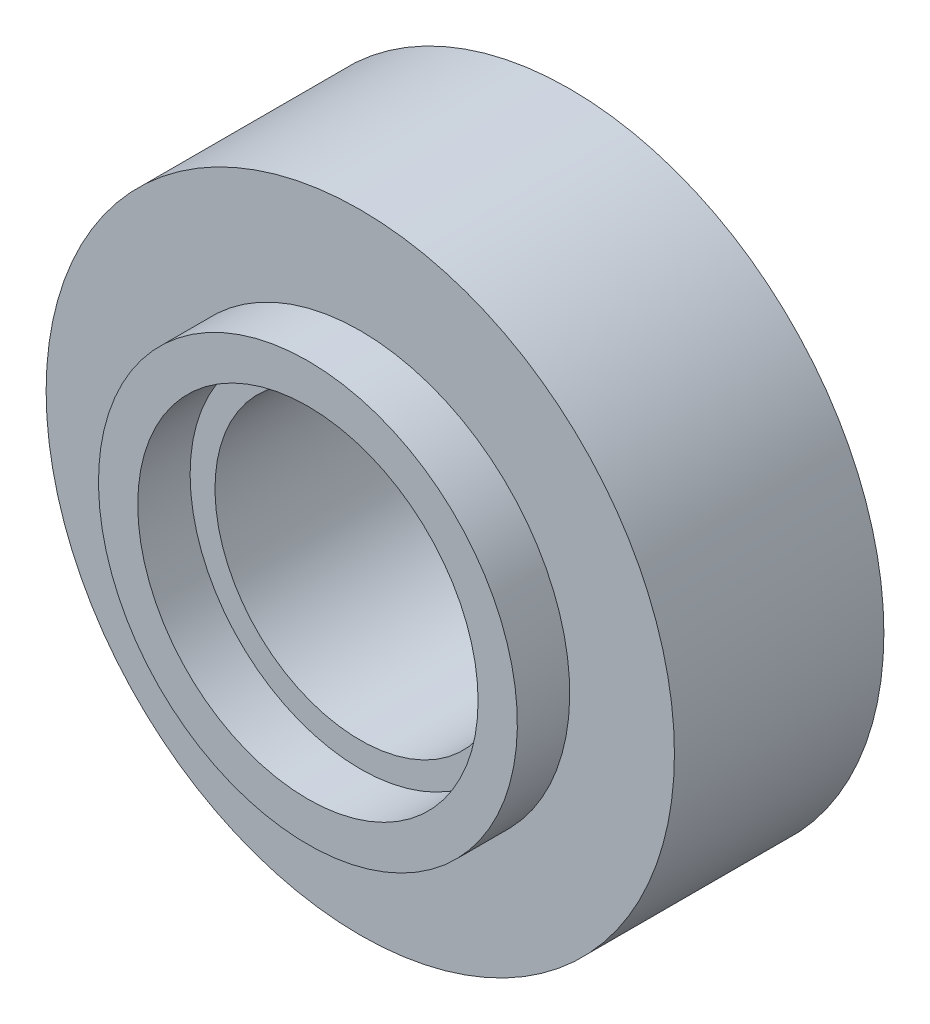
ISO-10303-21;
HEADER;
FILE_DESCRIPTION(('STEP AP214'),'2;1');
FILE_NAME('part.step','',(''),(''),'','','');
FILE_SCHEMA(('AUTOMOTIVE_DESIGN { 1 0 10303 214 1 1 1 1 }'));
ENDSEC;
DATA;
#1=APPLICATION_CONTEXT('core data for automotive mechanical design processes');
#2=APPLICATION_PROTOCOL_DEFINITION('international standard','automotive_design',2000,#1);
#3=PRODUCT_CONTEXT('',#1,'mechanical');
#4=PRODUCT('Part','Part','',(#3));
#5=PRODUCT_RELATED_PRODUCT_CATEGORY('part','',(#4));
#6=PRODUCT_DEFINITION_FORMATION('','',#4);
#7=PRODUCT_DEFINITION_CONTEXT('part definition',#1,'design');
#8=PRODUCT_DEFINITION('design','',#6,#7);
#9=PRODUCT_DEFINITION_SHAPE('','',#8);
#10=(LENGTH_UNIT() NAMED_UNIT(*) SI_UNIT(.MILLI.,.METRE.));
#11=(NAMED_UNIT(*) PLANE_ANGLE_UNIT() SI_UNIT($,.RADIAN.));
#12=(NAMED_UNIT(*) SI_UNIT($,.STERADIAN.) SOLID_ANGLE_UNIT());
#13=UNCERTAINTY_MEASURE_WITH_UNIT(LENGTH_MEASURE(1.E-05),#10,'distance_accuracy_value','');
#14=(GEOMETRIC_REPRESENTATION_CONTEXT(3) GLOBAL_UNCERTAINTY_ASSIGNED_CONTEXT((#13)) GLOBAL_UNIT_ASSIGNED_CONTEXT((#10,
#11,#12)) REPRESENTATION_CONTEXT('',''));
#15=CARTESIAN_POINT('',(0.,0.,0.));
#16=DIRECTION('',(0.,0.,1.));
#17=DIRECTION('',(1.,0.,0.));
#18=AXIS2_PLACEMENT_3D('',#15,#16,#17);
#19=CARTESIAN_POINT('',(0.,0.,-39.));
#20=DIRECTION('',(0.,0.,-1.));
#21=DIRECTION('',(0.,1.,0.));
#22=AXIS2_PLACEMENT_3D('',#19,#20,#21);
#23=PLANE('',#22);
#24=CARTESIAN_POINT('',(0.,0.,-39.));
#25=DIRECTION('',(0.,0.,-1.));
#26=DIRECTION('',(0.,1.,0.));
#27=AXIS2_PLACEMENT_3D('',#24,#25,#26);
#28=CIRCLE('',#27,8.);
#29=CARTESIAN_POINT('',(0.,8.00000000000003,-39.));
#30=VERTEX_POINT('',#29);
#31=EDGE_CURVE('E37',#30,#30,#28,.T.);
#32=ORIENTED_EDGE('',*,*,#31,.F.);
#33=EDGE_LOOP('',(#32));
#34=FACE_BOUND('',#33,.T.);
#35=CARTESIAN_POINT('',(0.,0.,-39.));
#36=DIRECTION('',(0.,0.,-1.));
#37=DIRECTION('',(0.,1.,0.));
#38=AXIS2_PLACEMENT_3D('',#35,#36,#37);
#39=CIRCLE('',#38,6.49999999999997);
#40=CARTESIAN_POINT('',(0.,6.5,-39.));
#41=VERTEX_POINT('',#40);
#42=EDGE_CURVE('E44',#41,#41,#39,.T.);
#43=ORIENTED_EDGE('',*,*,#42,.T.);
#44=EDGE_LOOP('',(#43));
#45=FACE_BOUND('',#44,.T.);
#46=ADVANCED_FACE('F33',(#34,#45),#23,.F.);
#47=CARTESIAN_POINT('',(0.,0.,-41.));
#48=DIRECTION('',(0.,0.,1.));
#49=DIRECTION('',(0.,-1.,0.));
#50=AXIS2_PLACEMENT_3D('',#47,#48,#49);
#51=CYLINDRICAL_SURFACE('',#50,8.);
#52=CARTESIAN_POINT('',(0.,0.,-41.));
#53=DIRECTION('',(0.,0.,-1.));
#54=DIRECTION('',(0.,1.,0.));
#55=AXIS2_PLACEMENT_3D('',#52,#53,#54);
#56=CIRCLE('',#55,8.);
#57=CARTESIAN_POINT('',(0.,8.00000000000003,-41.));
#58=VERTEX_POINT('',#57);
#59=EDGE_CURVE('E10',#58,#58,#56,.T.);
#60=ORIENTED_EDGE('',*,*,#59,.F.);
#61=EDGE_LOOP('',(#60));
#62=FACE_BOUND('',#61,.T.);
#63=ORIENTED_EDGE('',*,*,#31,.T.);
#64=EDGE_LOOP('',(#63));
#65=FACE_BOUND('',#64,.T.);
#66=ADVANCED_FACE('F35',(#62,#65),#51,.T.);
#67=CARTESIAN_POINT('',(0.,0.,-41.));
#68=DIRECTION('',(0.,0.,1.));
#69=DIRECTION('',(0.,-1.,0.));
#70=AXIS2_PLACEMENT_3D('',#67,#68,#69);
#71=CYLINDRICAL_SURFACE('',#70,6.49999999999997);
#72=CARTESIAN_POINT('',(0.,0.,-41.));
#73=DIRECTION('',(0.,0.,-1.));
#74=DIRECTION('',(0.,1.,0.));
#75=AXIS2_PLACEMENT_3D('',#72,#73,#74);
#76=CIRCLE('',#75,6.49999999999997);
#77=CARTESIAN_POINT('',(0.,6.5,-41.));
#78=VERTEX_POINT('',#77);
#79=EDGE_CURVE('E48',#78,#78,#76,.T.);
#80=ORIENTED_EDGE('',*,*,#79,.T.);
#81=EDGE_LOOP('',(#80));
#82=FACE_BOUND('',#81,.T.);
#83=ORIENTED_EDGE('',*,*,#42,.F.);
#84=EDGE_LOOP('',(#83));
#85=FACE_BOUND('',#84,.T.);
#86=ADVANCED_FACE('F107',(#82,#85),#71,.F.);
#87=CARTESIAN_POINT('',(0.,0.,-41.));
#88=DIRECTION('',(0.,0.,-1.));
#89=DIRECTION('',(0.,1.,0.));
#90=AXIS2_PLACEMENT_3D('',#87,#88,#89);
#91=PLANE('',#90);
#92=CARTESIAN_POINT('',(0.,0.,-41.));
#93=DIRECTION('',(0.,0.,-1.));
#94=DIRECTION('',(0.,1.,0.));
#95=AXIS2_PLACEMENT_3D('',#92,#93,#94);
#96=CIRCLE('',#95,5.55);
#97=CARTESIAN_POINT('',(0.,5.55000000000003,-41.));
#98=VERTEX_POINT('',#97);
#99=EDGE_CURVE('E58',#98,#98,#96,.T.);
#100=ORIENTED_EDGE('',*,*,#99,.T.);
#101=EDGE_LOOP('',(#100));
#102=FACE_BOUND('',#101,.T.);
#103=ORIENTED_EDGE('',*,*,#79,.F.);
#104=EDGE_LOOP('',(#103));
#105=FACE_BOUND('',#104,.T.);
#106=ADVANCED_FACE('F89',(#102,#105),#91,.F.);
#107=CARTESIAN_POINT('',(0.,0.,-49.));
#108=DIRECTION('',(0.,0.,-1.));
#109=DIRECTION('',(0.,1.,0.));
#110=AXIS2_PLACEMENT_3D('',#107,#108,#109);
#111=PLANE('',#110);
#112=CARTESIAN_POINT('',(0.,-8.74999999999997,-49.));
#113=DIRECTION('',(0.,0.,-1.));
#114=DIRECTION('',(0.,1.,0.));
#115=AXIS2_PLACEMENT_3D('',#112,#113,#114);
#116=CIRCLE('',#115,1.6);
#117=CARTESIAN_POINT('',(0.,-7.14999999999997,-49.));
#118=VERTEX_POINT('',#117);
#119=EDGE_CURVE('E70',#118,#118,#116,.T.);
#120=ORIENTED_EDGE('',*,*,#119,.F.);
#121=EDGE_LOOP('',(#120));
#122=FACE_BOUND('',#121,.T.);
#123=CARTESIAN_POINT('',(0.,8.74999999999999,-49.));
#124=DIRECTION('',(0.,0.,-1.));
#125=DIRECTION('',(0.,1.,0.));
#126=AXIS2_PLACEMENT_3D('',#123,#124,#125);
#127=CIRCLE('',#126,1.6);
#128=CARTESIAN_POINT('',(0.,10.35,-49.));
#129=VERTEX_POINT('',#128);
#130=EDGE_CURVE('E64',#129,#129,#127,.T.);
#131=ORIENTED_EDGE('',*,*,#130,.F.);
#132=EDGE_LOOP('',(#131));
#133=FACE_BOUND('',#132,.T.);
#134=CARTESIAN_POINT('',(0.,0.,-49.));
#135=DIRECTION('',(0.,0.,-1.));
#136=DIRECTION('',(0.,1.,0.));
#137=AXIS2_PLACEMENT_3D('',#134,#135,#136);
#138=CIRCLE('',#137,12.);
#139=CARTESIAN_POINT('',(0.,12.,-49.));
#140=VERTEX_POINT('',#139);
#141=EDGE_CURVE('E51',#140,#140,#138,.T.);
#142=ORIENTED_EDGE('',*,*,#141,.T.);
#143=EDGE_LOOP('',(#142));
#144=FACE_BOUND('',#143,.T.);
#145=CARTESIAN_POINT('',(0.,0.,-49.));
#146=DIRECTION('',(0.,0.,-1.));
#147=DIRECTION('',(0.,1.,0.));
#148=AXIS2_PLACEMENT_3D('',#145,#146,#147);
#149=CIRCLE('',#148,5.55);
#150=CARTESIAN_POINT('',(0.,5.55000000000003,-49.));
#151=VERTEX_POINT('',#150);
#152=EDGE_CURVE('E55',#151,#151,#149,.T.);
#153=ORIENTED_EDGE('',*,*,#152,.F.);
#154=EDGE_LOOP('',(#153));
#155=FACE_BOUND('',#154,.T.);
#156=ADVANCED_FACE('F85',(#122,#133,#144,#155),#111,.T.);
#157=ORIENTED_EDGE('',*,*,#59,.T.);
#158=EDGE_LOOP('',(#157));
#159=FACE_BOUND('',#158,.T.);
#160=CARTESIAN_POINT('',(0.,0.,-41.));
#161=DIRECTION('',(0.,0.,-1.));
#162=DIRECTION('',(0.,1.,0.));
#163=AXIS2_PLACEMENT_3D('',#160,#161,#162);
#164=CIRCLE('',#163,12.);
#165=CARTESIAN_POINT('',(0.,12.,-41.));
#166=VERTEX_POINT('',#165);
#167=EDGE_CURVE('E52',#166,#166,#164,.T.);
#168=ORIENTED_EDGE('',*,*,#167,.F.);
#169=EDGE_LOOP('',(#168));
#170=FACE_BOUND('',#169,.T.);
#171=ADVANCED_FACE('F88',(#159,#170),#91,.F.);
#172=CARTESIAN_POINT('',(0.,0.,-49.));
#173=DIRECTION('',(0.,0.,1.));
#174=DIRECTION('',(0.,-1.,0.));
#175=AXIS2_PLACEMENT_3D('',#172,#173,#174);
#176=CYLINDRICAL_SURFACE('',#175,12.);
#177=ORIENTED_EDGE('',*,*,#141,.F.);
#178=EDGE_LOOP('',(#177));
#179=FACE_BOUND('',#178,.T.);
#180=ORIENTED_EDGE('',*,*,#167,.T.);
#181=EDGE_LOOP('',(#180));
#182=FACE_BOUND('',#181,.T.);
#183=ADVANCED_FACE('F101',(#179,#182),#176,.T.);
#184=CARTESIAN_POINT('',(0.,0.,-49.));
#185=DIRECTION('',(0.,0.,1.));
#186=DIRECTION('',(0.,-1.,0.));
#187=AXIS2_PLACEMENT_3D('',#184,#185,#186);
#188=CYLINDRICAL_SURFACE('',#187,5.55);
#189=ORIENTED_EDGE('',*,*,#152,.T.);
#190=EDGE_LOOP('',(#189));
#191=FACE_BOUND('',#190,.T.);
#192=ORIENTED_EDGE('',*,*,#99,.F.);
#193=EDGE_LOOP('',(#192));
#194=FACE_BOUND('',#193,.T.);
#195=ADVANCED_FACE('F97',(#191,#194),#188,.F.);
#196=CARTESIAN_POINT('',(0.,8.74999999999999,-44.));
#197=DIRECTION('',(0.,0.,-1.));
#198=DIRECTION('',(0.,1.,0.));
#199=AXIS2_PLACEMENT_3D('',#196,#197,#198);
#200=CYLINDRICAL_SURFACE('',#199,1.6);
#201=CARTESIAN_POINT('',(0.,8.74999999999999,-44.));
#202=DIRECTION('',(0.,0.,-1.));
#203=DIRECTION('',(0.,1.,0.));
#204=AXIS2_PLACEMENT_3D('',#201,#202,#203);
#205=CIRCLE('',#204,1.6);
#206=CARTESIAN_POINT('',(0.,10.35,-44.));
#207=VERTEX_POINT('',#206);
#208=EDGE_CURVE('E67',#207,#207,#205,.T.);
#209=ORIENTED_EDGE('',*,*,#208,.F.);
#210=EDGE_LOOP('',(#209));
#211=FACE_BOUND('',#210,.T.);
#212=ORIENTED_EDGE('',*,*,#130,.T.);
#213=EDGE_LOOP('',(#212));
#214=FACE_BOUND('',#213,.T.);
#215=ADVANCED_FACE('F100',(#211,#214),#200,.F.);
#216=CARTESIAN_POINT('',(0.,8.74999999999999,-44.));
#217=DIRECTION('',(0.,0.,-1.));
#218=DIRECTION('',(0.,1.,0.));
#219=AXIS2_PLACEMENT_3D('',#216,#217,#218);
#220=PLANE('',#219);
#221=ORIENTED_EDGE('',*,*,#208,.T.);
#222=EDGE_LOOP('',(#221));
#223=FACE_BOUND('',#222,.T.);
#224=ADVANCED_FACE('F81',(#223),#220,.T.);
#225=CARTESIAN_POINT('',(0.,-8.74999999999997,-44.));
#226=DIRECTION('',(0.,0.,-1.));
#227=DIRECTION('',(0.,1.,0.));
#228=AXIS2_PLACEMENT_3D('',#225,#226,#227);
#229=CYLINDRICAL_SURFACE('',#228,1.6);
#230=CARTESIAN_POINT('',(0.,-8.74999999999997,-44.));
#231=DIRECTION('',(0.,0.,-1.));
#232=DIRECTION('',(0.,1.,0.));
#233=AXIS2_PLACEMENT_3D('',#230,#231,#232);
#234=CIRCLE('',#233,1.6);
#235=CARTESIAN_POINT('',(0.,-7.14999999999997,-44.));
#236=VERTEX_POINT('',#235);
#237=EDGE_CURVE('E61',#236,#236,#234,.T.);
#238=ORIENTED_EDGE('',*,*,#237,.F.);
#239=EDGE_LOOP('',(#238));
#240=FACE_BOUND('',#239,.T.);
#241=ORIENTED_EDGE('',*,*,#119,.T.);
#242=EDGE_LOOP('',(#241));
#243=FACE_BOUND('',#242,.T.);
#244=ADVANCED_FACE('F78',(#240,#243),#229,.F.);
#245=CARTESIAN_POINT('',(0.,-8.74999999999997,-44.));
#246=DIRECTION('',(0.,0.,-1.));
#247=DIRECTION('',(0.,1.,0.));
#248=AXIS2_PLACEMENT_3D('',#245,#246,#247);
#249=PLANE('',#248);
#250=ORIENTED_EDGE('',*,*,#237,.T.);
#251=EDGE_LOOP('',(#250));
#252=FACE_BOUND('',#251,.T.);
#253=ADVANCED_FACE('F76',(#252),#249,.T.);
#254=CLOSED_SHELL('',(#46,#66,#86,#106,#156,#171,#183,#195,#215,#224,#244,#253));
#255=MANIFOLD_SOLID_BREP('B2',#254);
#256=ADVANCED_BREP_SHAPE_REPRESENTATION('',(#18,#255),#14);
#257=SHAPE_DEFINITION_REPRESENTATION(#9,#256);
ENDSEC;
END-ISO-10303-21;
